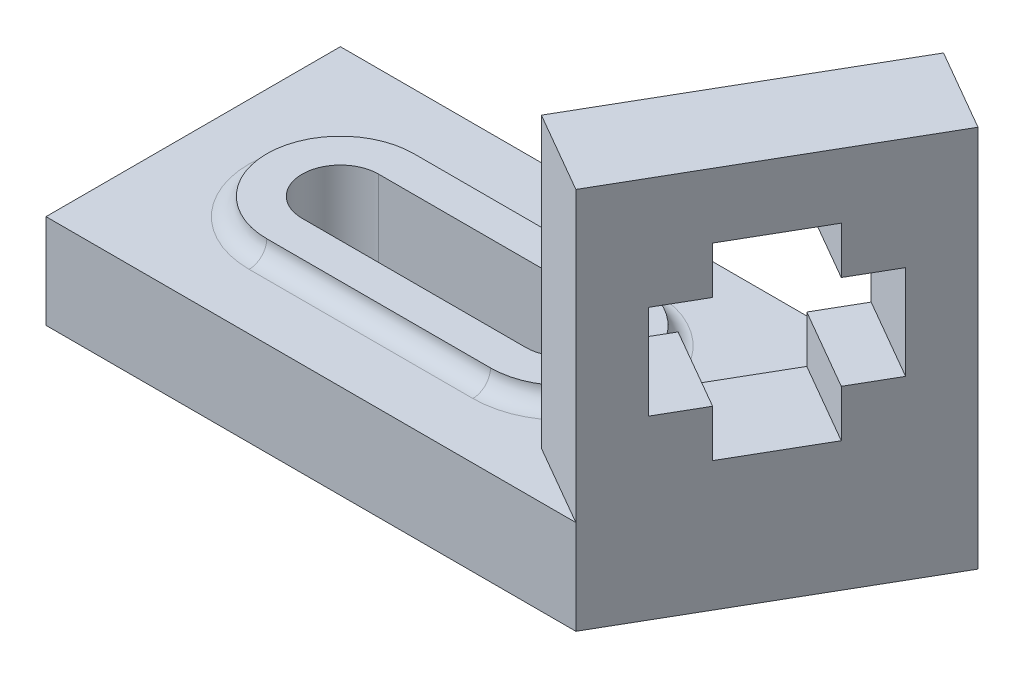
ISO-10303-21;
HEADER;
FILE_DESCRIPTION(('STEP AP214'),'2;1');
FILE_NAME('part.step','',(''),(''),'','','');
FILE_SCHEMA(('AUTOMOTIVE_DESIGN { 1 0 10303 214 1 1 1 1 }'));
ENDSEC;
DATA;
#1=APPLICATION_CONTEXT('core data for automotive mechanical design processes');
#2=APPLICATION_PROTOCOL_DEFINITION('international standard','automotive_design',2000,#1);
#3=PRODUCT_CONTEXT('',#1,'mechanical');
#4=PRODUCT('Part','Part','',(#3));
#5=PRODUCT_RELATED_PRODUCT_CATEGORY('part','',(#4));
#6=PRODUCT_DEFINITION_FORMATION('','',#4);
#7=PRODUCT_DEFINITION_CONTEXT('part definition',#1,'design');
#8=PRODUCT_DEFINITION('design','',#6,#7);
#9=PRODUCT_DEFINITION_SHAPE('','',#8);
#10=(LENGTH_UNIT() NAMED_UNIT(*) SI_UNIT(.MILLI.,.METRE.));
#11=(NAMED_UNIT(*) PLANE_ANGLE_UNIT() SI_UNIT($,.RADIAN.));
#12=(NAMED_UNIT(*) SI_UNIT($,.STERADIAN.) SOLID_ANGLE_UNIT());
#13=UNCERTAINTY_MEASURE_WITH_UNIT(LENGTH_MEASURE(1.E-05),#10,'distance_accuracy_value','');
#14=(GEOMETRIC_REPRESENTATION_CONTEXT(3) GLOBAL_UNCERTAINTY_ASSIGNED_CONTEXT((#13)) GLOBAL_UNIT_ASSIGNED_CONTEXT((#10,
#11,#12)) REPRESENTATION_CONTEXT('',''));
#15=CARTESIAN_POINT('',(0.,0.,0.));
#16=DIRECTION('',(0.,0.,1.));
#17=DIRECTION('',(1.,0.,0.));
#18=AXIS2_PLACEMENT_3D('',#15,#16,#17);
#19=CARTESIAN_POINT('',(0.,16.,0.));
#20=DIRECTION('',(0.,-1.,0.));
#21=DIRECTION('',(0.,0.,-1.));
#22=AXIS2_PLACEMENT_3D('',#19,#20,#21);
#23=PLANE('',#22);
#24=CARTESIAN_POINT('',(25.,16.,-25.));
#25=DIRECTION('',(0.,-1.,0.));
#26=DIRECTION('',(0.,0.,-1.));
#27=AXIS2_PLACEMENT_3D('',#24,#25,#26);
#28=CIRCLE('',#27,15.5);
#29=CARTESIAN_POINT('',(25.,16.,-9.50000000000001));
#30=VERTEX_POINT('',#29);
#31=CARTESIAN_POINT('',(25.,16.,-40.5));
#32=VERTEX_POINT('',#31);
#33=EDGE_CURVE('E434',#30,#32,#28,.T.);
#34=ORIENTED_EDGE('',*,*,#33,.T.);
#35=DIRECTION('',(-1.,0.,0.));
#36=VECTOR('',#35,1.);
#37=CARTESIAN_POINT('',(63.,16.,-40.5));
#38=LINE('',#37,#36);
#39=CARTESIAN_POINT('',(63.,16.,-40.5));
#40=VERTEX_POINT('',#39);
#41=EDGE_CURVE('E11',#32,#40,#38,.F.);
#42=ORIENTED_EDGE('',*,*,#41,.T.);
#43=CARTESIAN_POINT('',(63.,16.,-25.));
#44=DIRECTION('',(0.,-1.,0.));
#45=DIRECTION('',(0.,0.,-1.));
#46=AXIS2_PLACEMENT_3D('',#43,#44,#45);
#47=CIRCLE('',#46,15.5);
#48=CARTESIAN_POINT('',(63.,16.,-9.5));
#49=VERTEX_POINT('',#48);
#50=EDGE_CURVE('E42',#40,#49,#47,.T.);
#51=ORIENTED_EDGE('',*,*,#50,.T.);
#52=DIRECTION('',(1.,0.,0.));
#53=VECTOR('',#52,1.);
#54=CARTESIAN_POINT('',(25.,16.,-9.5));
#55=LINE('',#54,#53);
#56=EDGE_CURVE('E436',#49,#30,#55,.F.);
#57=ORIENTED_EDGE('',*,*,#56,.T.);
#58=EDGE_LOOP('',(#34,#42,#51,#57));
#59=FACE_BOUND('',#58,.T.);
#60=DIRECTION('',(0.86602540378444,0.,0.499999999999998));
#61=VECTOR('',#60,1.);
#62=CARTESIAN_POINT('',(76.143593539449,16.,-7.99999999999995));
#63=LINE('',#62,#61);
#64=CARTESIAN_POINT('',(76.143593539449,16.,-7.99999999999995));
#65=VERTEX_POINT('',#64);
#66=CARTESIAN_POINT('',(90.,16.,0.));
#67=VERTEX_POINT('',#66);
#68=EDGE_CURVE('E382',#65,#67,#63,.T.);
#69=ORIENTED_EDGE('',*,*,#68,.F.);
#70=DIRECTION('',(0.499999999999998,0.,-0.86602540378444));
#71=VECTOR('',#70,1.);
#72=CARTESIAN_POINT('',(76.143593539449,16.,-7.99999999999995));
#73=LINE('',#72,#71);
#74=CARTESIAN_POINT('',(101.143593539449,16.,-51.301270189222));
#75=VERTEX_POINT('',#74);
#76=EDGE_CURVE('E372',#65,#75,#73,.T.);
#77=ORIENTED_EDGE('',*,*,#76,.T.);
#78=DIRECTION('',(-0.993250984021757,0.,0.115984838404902));
#79=VECTOR('',#78,1.);
#80=CARTESIAN_POINT('',(101.143593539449,16.,-51.301270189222));
#81=LINE('',#80,#79);
#82=CARTESIAN_POINT('',(90.,16.,-50.));
#83=VERTEX_POINT('',#82);
#84=EDGE_CURVE('E401',#75,#83,#81,.T.);
#85=ORIENTED_EDGE('',*,*,#84,.T.);
#86=DIRECTION('',(-1.,0.,0.));
#87=VECTOR('',#86,1.);
#88=CARTESIAN_POINT('',(0.,16.,-50.));
#89=LINE('',#88,#87);
#90=CARTESIAN_POINT('',(0.,16.,-50.));
#91=VERTEX_POINT('',#90);
#92=EDGE_CURVE('E403',#83,#91,#89,.T.);
#93=ORIENTED_EDGE('',*,*,#92,.T.);
#94=DIRECTION('',(0.,0.,1.));
#95=VECTOR('',#94,1.);
#96=CARTESIAN_POINT('',(0.,16.,0.));
#97=LINE('',#96,#95);
#98=CARTESIAN_POINT('',(0.,16.,0.));
#99=VERTEX_POINT('',#98);
#100=EDGE_CURVE('E394',#91,#99,#97,.T.);
#101=ORIENTED_EDGE('',*,*,#100,.T.);
#102=DIRECTION('',(1.,0.,0.));
#103=VECTOR('',#102,1.);
#104=CARTESIAN_POINT('',(0.,16.,0.));
#105=LINE('',#104,#103);
#106=EDGE_CURVE('E397',#99,#67,#105,.T.);
#107=ORIENTED_EDGE('',*,*,#106,.T.);
#108=EDGE_LOOP('',(#69,#77,#85,#93,#101,#107));
#109=FACE_BOUND('',#108,.T.);
#110=ADVANCED_FACE('F33',(#59,#109),#23,.F.);
#111=CARTESIAN_POINT('',(0.,16.,0.));
#112=DIRECTION('',(1.,0.,0.));
#113=DIRECTION('',(0.,0.,-1.));
#114=AXIS2_PLACEMENT_3D('',#111,#112,#113);
#115=PLANE('',#114);
#116=DIRECTION('',(0.,0.,1.));
#117=VECTOR('',#116,1.);
#118=CARTESIAN_POINT('',(0.,0.,0.));
#119=LINE('',#118,#117);
#120=CARTESIAN_POINT('',(0.,0.,-50.));
#121=VERTEX_POINT('',#120);
#122=CARTESIAN_POINT('',(0.,0.,0.));
#123=VERTEX_POINT('',#122);
#124=EDGE_CURVE('E389',#121,#123,#119,.T.);
#125=ORIENTED_EDGE('',*,*,#124,.T.);
#126=DIRECTION('',(0.,-1.,0.));
#127=VECTOR('',#126,1.);
#128=CARTESIAN_POINT('',(0.,16.,0.));
#129=LINE('',#128,#127);
#130=EDGE_CURVE('E431',#99,#123,#129,.T.);
#131=ORIENTED_EDGE('',*,*,#130,.F.);
#132=ORIENTED_EDGE('',*,*,#100,.F.);
#133=DIRECTION('',(0.,-1.,0.));
#134=VECTOR('',#133,1.);
#135=CARTESIAN_POINT('',(0.,16.,-50.));
#136=LINE('',#135,#134);
#137=EDGE_CURVE('E405',#91,#121,#136,.T.);
#138=ORIENTED_EDGE('',*,*,#137,.T.);
#139=EDGE_LOOP('',(#125,#131,#132,#138));
#140=FACE_BOUND('',#139,.T.);
#141=ADVANCED_FACE('F469',(#140),#115,.F.);
#142=CARTESIAN_POINT('',(0.,16.,0.));
#143=DIRECTION('',(0.,0.,-1.));
#144=DIRECTION('',(-1.,0.,0.));
#145=AXIS2_PLACEMENT_3D('',#142,#143,#144);
#146=PLANE('',#145);
#147=DIRECTION('',(1.,0.,0.));
#148=VECTOR('',#147,1.);
#149=CARTESIAN_POINT('',(0.,0.,0.));
#150=LINE('',#149,#148);
#151=CARTESIAN_POINT('',(90.,0.,0.));
#152=VERTEX_POINT('',#151);
#153=EDGE_CURVE('E408',#123,#152,#150,.T.);
#154=ORIENTED_EDGE('',*,*,#153,.T.);
#155=DIRECTION('',(0.,-1.,0.));
#156=VECTOR('',#155,1.);
#157=CARTESIAN_POINT('',(90.,16.,0.));
#158=LINE('',#157,#156);
#159=EDGE_CURVE('E428',#67,#152,#158,.T.);
#160=ORIENTED_EDGE('',*,*,#159,.F.);
#161=ORIENTED_EDGE('',*,*,#106,.F.);
#162=ORIENTED_EDGE('',*,*,#130,.T.);
#163=EDGE_LOOP('',(#154,#160,#161,#162));
#164=FACE_BOUND('',#163,.T.);
#165=ADVANCED_FACE('F474',(#164),#146,.F.);
#166=CARTESIAN_POINT('',(90.,16.,0.));
#167=DIRECTION('',(-0.86602540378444,0.,-0.499999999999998));
#168=DIRECTION('',(-0.499999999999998,0.,0.86602540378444));
#169=AXIS2_PLACEMENT_3D('',#166,#167,#168);
#170=PLANE('',#169);
#171=DIRECTION('',(0.499999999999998,0.,-0.86602540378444));
#172=VECTOR('',#171,1.);
#173=CARTESIAN_POINT('',(90.,0.,0.));
#174=LINE('',#173,#172);
#175=CARTESIAN_POINT('',(115.,0.,-43.301270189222));
#176=VERTEX_POINT('',#175);
#177=EDGE_CURVE('E410',#152,#176,#174,.T.);
#178=ORIENTED_EDGE('',*,*,#177,.T.);
#179=DIRECTION('',(0.,-1.,0.));
#180=VECTOR('',#179,1.);
#181=CARTESIAN_POINT('',(115.,16.,-43.301270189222));
#182=LINE('',#181,#180);
#183=CARTESIAN_POINT('',(115.,65.,-43.301270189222));
#184=VERTEX_POINT('',#183);
#185=EDGE_CURVE('E425',#184,#176,#182,.T.);
#186=ORIENTED_EDGE('',*,*,#185,.F.);
#187=DIRECTION('',(-0.499999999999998,0.,0.86602540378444));
#188=VECTOR('',#187,1.);
#189=CARTESIAN_POINT('',(90.,65.,0.));
#190=LINE('',#189,#188);
#191=CARTESIAN_POINT('',(90.,65.,0.));
#192=VERTEX_POINT('',#191);
#193=EDGE_CURVE('E373',#184,#192,#190,.T.);
#194=ORIENTED_EDGE('',*,*,#193,.T.);
#195=DIRECTION('',(0.,-1.,0.));
#196=VECTOR('',#195,1.);
#197=CARTESIAN_POINT('',(90.,16.,0.));
#198=LINE('',#197,#196);
#199=EDGE_CURVE('E346',#192,#67,#198,.T.);
#200=ORIENTED_EDGE('',*,*,#199,.T.);
#201=ORIENTED_EDGE('',*,*,#159,.T.);
#202=EDGE_LOOP('',(#178,#186,#194,#200,#201));
#203=FACE_BOUND('',#202,.T.);
#204=DIRECTION('',(0.499999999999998,0.,-0.86602540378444));
#205=VECTOR('',#204,1.);
#206=CARTESIAN_POINT('',(94.5,30.,-7.79422863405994));
#207=LINE('',#206,#205);
#208=CARTESIAN_POINT('',(94.5,30.,-7.79422863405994));
#209=VERTEX_POINT('',#208);
#210=CARTESIAN_POINT('',(98.5,30.,-14.7224318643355));
#211=VERTEX_POINT('',#210);
#212=EDGE_CURVE('E312',#209,#211,#207,.T.);
#213=ORIENTED_EDGE('',*,*,#212,.F.);
#214=DIRECTION('',(0.,-1.,0.));
#215=VECTOR('',#214,1.);
#216=CARTESIAN_POINT('',(94.5,46.,-7.79422863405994));
#217=LINE('',#216,#215);
#218=CARTESIAN_POINT('',(94.5,46.,-7.79422863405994));
#219=VERTEX_POINT('',#218);
#220=EDGE_CURVE('E269',#219,#209,#217,.T.);
#221=ORIENTED_EDGE('',*,*,#220,.F.);
#222=DIRECTION('',(-0.499999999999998,0.,0.86602540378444));
#223=VECTOR('',#222,1.);
#224=CARTESIAN_POINT('',(94.5,46.,-7.79422863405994));
#225=LINE('',#224,#223);
#226=CARTESIAN_POINT('',(98.5,46.,-14.7224318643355));
#227=VERTEX_POINT('',#226);
#228=EDGE_CURVE('E277',#227,#219,#225,.T.);
#229=ORIENTED_EDGE('',*,*,#228,.F.);
#230=DIRECTION('',(0.,-1.,0.));
#231=VECTOR('',#230,1.);
#232=CARTESIAN_POINT('',(98.5,54.,-14.7224318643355));
#233=LINE('',#232,#231);
#234=CARTESIAN_POINT('',(98.5,54.,-14.7224318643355));
#235=VERTEX_POINT('',#234);
#236=EDGE_CURVE('E339',#235,#227,#233,.T.);
#237=ORIENTED_EDGE('',*,*,#236,.F.);
#238=DIRECTION('',(-0.499999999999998,0.,0.86602540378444));
#239=VECTOR('',#238,1.);
#240=CARTESIAN_POINT('',(98.5,54.,-14.7224318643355));
#241=LINE('',#240,#239);
#242=CARTESIAN_POINT('',(106.5,54.,-28.5788383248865));
#243=VERTEX_POINT('',#242);
#244=EDGE_CURVE('E336',#243,#235,#241,.T.);
#245=ORIENTED_EDGE('',*,*,#244,.F.);
#246=DIRECTION('',(0.,1.,0.));
#247=VECTOR('',#246,1.);
#248=CARTESIAN_POINT('',(106.5,54.,-28.5788383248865));
#249=LINE('',#248,#247);
#250=CARTESIAN_POINT('',(106.5,46.,-28.5788383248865));
#251=VERTEX_POINT('',#250);
#252=EDGE_CURVE('E333',#251,#243,#249,.T.);
#253=ORIENTED_EDGE('',*,*,#252,.F.);
#254=DIRECTION('',(-0.499999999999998,0.,0.86602540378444));
#255=VECTOR('',#254,1.);
#256=CARTESIAN_POINT('',(106.5,46.,-28.5788383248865));
#257=LINE('',#256,#255);
#258=CARTESIAN_POINT('',(110.5,46.,-35.507041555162));
#259=VERTEX_POINT('',#258);
#260=EDGE_CURVE('E330',#259,#251,#257,.T.);
#261=ORIENTED_EDGE('',*,*,#260,.F.);
#262=DIRECTION('',(0.,1.,0.));
#263=VECTOR('',#262,1.);
#264=CARTESIAN_POINT('',(110.5,46.,-35.507041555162));
#265=LINE('',#264,#263);
#266=CARTESIAN_POINT('',(110.5,30.,-35.507041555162));
#267=VERTEX_POINT('',#266);
#268=EDGE_CURVE('E327',#267,#259,#265,.T.);
#269=ORIENTED_EDGE('',*,*,#268,.F.);
#270=DIRECTION('',(0.499999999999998,0.,-0.86602540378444));
#271=VECTOR('',#270,1.);
#272=CARTESIAN_POINT('',(106.5,30.,-28.5788383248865));
#273=LINE('',#272,#271);
#274=CARTESIAN_POINT('',(106.5,30.,-28.5788383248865));
#275=VERTEX_POINT('',#274);
#276=EDGE_CURVE('E324',#275,#267,#273,.T.);
#277=ORIENTED_EDGE('',*,*,#276,.F.);
#278=DIRECTION('',(0.,1.,0.));
#279=VECTOR('',#278,1.);
#280=CARTESIAN_POINT('',(106.5,30.,-28.5788383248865));
#281=LINE('',#280,#279);
#282=CARTESIAN_POINT('',(106.5,22.,-28.5788383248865));
#283=VERTEX_POINT('',#282);
#284=EDGE_CURVE('E321',#283,#275,#281,.T.);
#285=ORIENTED_EDGE('',*,*,#284,.F.);
#286=DIRECTION('',(0.499999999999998,0.,-0.86602540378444));
#287=VECTOR('',#286,1.);
#288=CARTESIAN_POINT('',(98.5,22.,-14.7224318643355));
#289=LINE('',#288,#287);
#290=CARTESIAN_POINT('',(98.5,22.,-14.7224318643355));
#291=VERTEX_POINT('',#290);
#292=EDGE_CURVE('E318',#291,#283,#289,.T.);
#293=ORIENTED_EDGE('',*,*,#292,.F.);
#294=DIRECTION('',(0.,-1.,0.));
#295=VECTOR('',#294,1.);
#296=CARTESIAN_POINT('',(98.5,30.,-14.7224318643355));
#297=LINE('',#296,#295);
#298=EDGE_CURVE('E315',#211,#291,#297,.T.);
#299=ORIENTED_EDGE('',*,*,#298,.F.);
#300=EDGE_LOOP('',(#213,#221,#229,#237,#245,#253,#261,#269,#277,#285,#293,#299));
#301=FACE_BOUND('',#300,.T.);
#302=ADVANCED_FACE('F496',(#203,#301),#170,.F.);
#303=CARTESIAN_POINT('',(115.,16.,-43.301270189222));
#304=DIRECTION('',(-0.499999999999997,0.,0.86602540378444));
#305=DIRECTION('',(0.86602540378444,0.,0.499999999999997));
#306=AXIS2_PLACEMENT_3D('',#303,#304,#305);
#307=PLANE('',#306);
#308=DIRECTION('',(-0.86602540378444,0.,-0.499999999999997));
#309=VECTOR('',#308,1.);
#310=CARTESIAN_POINT('',(115.,0.,-43.301270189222));
#311=LINE('',#310,#309);
#312=CARTESIAN_POINT('',(101.143593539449,0.,-51.301270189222));
#313=VERTEX_POINT('',#312);
#314=EDGE_CURVE('E412',#176,#313,#311,.T.);
#315=ORIENTED_EDGE('',*,*,#314,.T.);
#316=DIRECTION('',(0.,-1.,0.));
#317=VECTOR('',#316,1.);
#318=CARTESIAN_POINT('',(101.143593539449,16.,-51.301270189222));
#319=LINE('',#318,#317);
#320=EDGE_CURVE('E422',#75,#313,#319,.T.);
#321=ORIENTED_EDGE('',*,*,#320,.F.);
#322=DIRECTION('',(0.,1.,0.));
#323=VECTOR('',#322,1.);
#324=CARTESIAN_POINT('',(101.143593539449,16.,-51.3012701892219));
#325=LINE('',#324,#323);
#326=CARTESIAN_POINT('',(101.143593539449,65.,-51.3012701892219));
#327=VERTEX_POINT('',#326);
#328=EDGE_CURVE('E376',#75,#327,#325,.T.);
#329=ORIENTED_EDGE('',*,*,#328,.T.);
#330=DIRECTION('',(0.86602540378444,0.,0.499999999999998));
#331=VECTOR('',#330,1.);
#332=CARTESIAN_POINT('',(101.143593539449,65.,-51.3012701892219));
#333=LINE('',#332,#331);
#334=EDGE_CURVE('E390',#327,#184,#333,.T.);
#335=ORIENTED_EDGE('',*,*,#334,.T.);
#336=ORIENTED_EDGE('',*,*,#185,.T.);
#337=EDGE_LOOP('',(#315,#321,#329,#335,#336));
#338=FACE_BOUND('',#337,.T.);
#339=ADVANCED_FACE('F492',(#338),#307,.F.);
#340=CARTESIAN_POINT('',(101.143593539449,16.,-51.301270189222));
#341=DIRECTION('',(0.115984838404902,0.,0.993250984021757));
#342=DIRECTION('',(0.993250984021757,0.,-0.115984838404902));
#343=AXIS2_PLACEMENT_3D('',#340,#341,#342);
#344=PLANE('',#343);
#345=DIRECTION('',(-0.993250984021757,0.,0.115984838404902));
#346=VECTOR('',#345,1.);
#347=CARTESIAN_POINT('',(101.143593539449,0.,-51.301270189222));
#348=LINE('',#347,#346);
#349=CARTESIAN_POINT('',(90.,0.,-50.));
#350=VERTEX_POINT('',#349);
#351=EDGE_CURVE('E414',#313,#350,#348,.T.);
#352=ORIENTED_EDGE('',*,*,#351,.T.);
#353=DIRECTION('',(0.,-1.,0.));
#354=VECTOR('',#353,1.);
#355=CARTESIAN_POINT('',(90.,16.,-50.));
#356=LINE('',#355,#354);
#357=EDGE_CURVE('E419',#83,#350,#356,.T.);
#358=ORIENTED_EDGE('',*,*,#357,.F.);
#359=ORIENTED_EDGE('',*,*,#84,.F.);
#360=ORIENTED_EDGE('',*,*,#320,.T.);
#361=EDGE_LOOP('',(#352,#358,#359,#360));
#362=FACE_BOUND('',#361,.T.);
#363=ADVANCED_FACE('F488',(#362),#344,.F.);
#364=CARTESIAN_POINT('',(0.,16.,-50.));
#365=DIRECTION('',(0.,0.,1.));
#366=DIRECTION('',(1.,0.,0.));
#367=AXIS2_PLACEMENT_3D('',#364,#365,#366);
#368=PLANE('',#367);
#369=DIRECTION('',(-1.,0.,0.));
#370=VECTOR('',#369,1.);
#371=CARTESIAN_POINT('',(0.,0.,-50.));
#372=LINE('',#371,#370);
#373=EDGE_CURVE('E398',#350,#121,#372,.T.);
#374=ORIENTED_EDGE('',*,*,#373,.T.);
#375=ORIENTED_EDGE('',*,*,#137,.F.);
#376=ORIENTED_EDGE('',*,*,#92,.F.);
#377=ORIENTED_EDGE('',*,*,#357,.T.);
#378=EDGE_LOOP('',(#374,#375,#376,#377));
#379=FACE_BOUND('',#378,.T.);
#380=ADVANCED_FACE('F484',(#379),#368,.F.);
#381=CARTESIAN_POINT('',(0.,0.,0.));
#382=DIRECTION('',(0.,-1.,0.));
#383=DIRECTION('',(0.,0.,-1.));
#384=AXIS2_PLACEMENT_3D('',#381,#382,#383);
#385=PLANE('',#384);
#386=CARTESIAN_POINT('',(25.,0.,-25.));
#387=DIRECTION('',(0.,1.,0.));
#388=DIRECTION('',(0.,0.,1.));
#389=AXIS2_PLACEMENT_3D('',#386,#387,#388);
#390=CIRCLE('',#389,6.5);
#391=CARTESIAN_POINT('',(25.,0.,-31.5));
#392=VERTEX_POINT('',#391);
#393=CARTESIAN_POINT('',(25.,0.,-18.5));
#394=VERTEX_POINT('',#393);
#395=EDGE_CURVE('E260',#392,#394,#390,.T.);
#396=ORIENTED_EDGE('',*,*,#395,.T.);
#397=DIRECTION('',(1.,0.,0.));
#398=VECTOR('',#397,1.);
#399=CARTESIAN_POINT('',(25.,0.,-18.5));
#400=LINE('',#399,#398);
#401=CARTESIAN_POINT('',(63.,0.,-18.5));
#402=VERTEX_POINT('',#401);
#403=EDGE_CURVE('E228',#394,#402,#400,.T.);
#404=ORIENTED_EDGE('',*,*,#403,.T.);
#405=CARTESIAN_POINT('',(63.,0.,-25.));
#406=DIRECTION('',(0.,1.,0.));
#407=DIRECTION('',(0.,0.,1.));
#408=AXIS2_PLACEMENT_3D('',#405,#406,#407);
#409=CIRCLE('',#408,6.5);
#410=CARTESIAN_POINT('',(63.,0.,-31.5));
#411=VERTEX_POINT('',#410);
#412=EDGE_CURVE('E263',#402,#411,#409,.T.);
#413=ORIENTED_EDGE('',*,*,#412,.T.);
#414=DIRECTION('',(-1.,0.,0.));
#415=VECTOR('',#414,1.);
#416=CARTESIAN_POINT('',(25.,0.,-31.5));
#417=LINE('',#416,#415);
#418=EDGE_CURVE('E233',#411,#392,#417,.T.);
#419=ORIENTED_EDGE('',*,*,#418,.T.);
#420=EDGE_LOOP('',(#396,#404,#413,#419));
#421=FACE_BOUND('',#420,.T.);
#422=ORIENTED_EDGE('',*,*,#124,.F.);
#423=ORIENTED_EDGE('',*,*,#373,.F.);
#424=ORIENTED_EDGE('',*,*,#351,.F.);
#425=ORIENTED_EDGE('',*,*,#314,.F.);
#426=ORIENTED_EDGE('',*,*,#177,.F.);
#427=ORIENTED_EDGE('',*,*,#153,.F.);
#428=EDGE_LOOP('',(#422,#423,#424,#425,#426,#427));
#429=FACE_BOUND('',#428,.T.);
#430=ADVANCED_FACE('F481',(#421,#429),#385,.T.);
#431=CARTESIAN_POINT('',(76.143593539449,16.,-7.99999999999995));
#432=DIRECTION('',(-0.499999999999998,0.,0.86602540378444));
#433=DIRECTION('',(0.86602540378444,0.,0.499999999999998));
#434=AXIS2_PLACEMENT_3D('',#431,#432,#433);
#435=PLANE('',#434);
#436=ORIENTED_EDGE('',*,*,#199,.F.);
#437=DIRECTION('',(0.86602540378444,0.,0.499999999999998));
#438=VECTOR('',#437,1.);
#439=CARTESIAN_POINT('',(76.143593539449,65.,-7.99999999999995));
#440=LINE('',#439,#438);
#441=CARTESIAN_POINT('',(76.143593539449,65.,-7.99999999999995));
#442=VERTEX_POINT('',#441);
#443=EDGE_CURVE('E387',#442,#192,#440,.T.);
#444=ORIENTED_EDGE('',*,*,#443,.F.);
#445=DIRECTION('',(0.,-1.,0.));
#446=VECTOR('',#445,1.);
#447=CARTESIAN_POINT('',(76.143593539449,16.,-7.99999999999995));
#448=LINE('',#447,#446);
#449=EDGE_CURVE('E369',#442,#65,#448,.T.);
#450=ORIENTED_EDGE('',*,*,#449,.T.);
#451=ORIENTED_EDGE('',*,*,#68,.T.);
#452=EDGE_LOOP('',(#436,#444,#450,#451));
#453=FACE_BOUND('',#452,.T.);
#454=ADVANCED_FACE('F479',(#453),#435,.T.);
#455=CARTESIAN_POINT('',(76.143593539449,65.,-7.99999999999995));
#456=DIRECTION('',(0.,1.,0.));
#457=DIRECTION('',(0.,0.,1.));
#458=AXIS2_PLACEMENT_3D('',#455,#456,#457);
#459=PLANE('',#458);
#460=ORIENTED_EDGE('',*,*,#193,.F.);
#461=ORIENTED_EDGE('',*,*,#334,.F.);
#462=DIRECTION('',(-0.499999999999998,0.,0.86602540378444));
#463=VECTOR('',#462,1.);
#464=CARTESIAN_POINT('',(76.143593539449,65.,-7.99999999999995));
#465=LINE('',#464,#463);
#466=EDGE_CURVE('E379',#327,#442,#465,.T.);
#467=ORIENTED_EDGE('',*,*,#466,.T.);
#468=ORIENTED_EDGE('',*,*,#443,.T.);
#469=EDGE_LOOP('',(#460,#461,#467,#468));
#470=FACE_BOUND('',#469,.T.);
#471=ADVANCED_FACE('F716',(#470),#459,.T.);
#472=CARTESIAN_POINT('',(53.6435935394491,0.,30.9711431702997));
#473=DIRECTION('',(-0.86602540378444,0.,-0.499999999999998));
#474=DIRECTION('',(-0.499999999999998,0.,0.86602540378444));
#475=AXIS2_PLACEMENT_3D('',#472,#473,#474);
#476=PLANE('',#475);
#477=DIRECTION('',(0.,-1.,0.));
#478=VECTOR('',#477,1.);
#479=CARTESIAN_POINT('',(80.643593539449,46.,-15.7942286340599));
#480=LINE('',#479,#478);
#481=CARTESIAN_POINT('',(80.643593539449,46.,-15.7942286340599));
#482=VERTEX_POINT('',#481);
#483=CARTESIAN_POINT('',(80.643593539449,30.,-15.7942286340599));
#484=VERTEX_POINT('',#483);
#485=EDGE_CURVE('E273',#482,#484,#480,.T.);
#486=ORIENTED_EDGE('',*,*,#485,.T.);
#487=DIRECTION('',(0.499999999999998,0.,-0.86602540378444));
#488=VECTOR('',#487,1.);
#489=CARTESIAN_POINT('',(80.643593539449,30.,-15.7942286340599));
#490=LINE('',#489,#488);
#491=CARTESIAN_POINT('',(84.6435935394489,30.,-22.7224318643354));
#492=VERTEX_POINT('',#491);
#493=EDGE_CURVE('E276',#484,#492,#490,.T.);
#494=ORIENTED_EDGE('',*,*,#493,.T.);
#495=DIRECTION('',(0.,-1.,0.));
#496=VECTOR('',#495,1.);
#497=CARTESIAN_POINT('',(84.6435935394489,30.,-22.7224318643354));
#498=LINE('',#497,#496);
#499=CARTESIAN_POINT('',(84.6435935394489,22.,-22.7224318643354));
#500=VERTEX_POINT('',#499);
#501=EDGE_CURVE('E280',#492,#500,#498,.T.);
#502=ORIENTED_EDGE('',*,*,#501,.T.);
#503=DIRECTION('',(0.499999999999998,0.,-0.86602540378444));
#504=VECTOR('',#503,1.);
#505=CARTESIAN_POINT('',(84.6435935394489,22.,-22.7224318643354));
#506=LINE('',#505,#504);
#507=CARTESIAN_POINT('',(92.6435935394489,22.,-36.5788383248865));
#508=VERTEX_POINT('',#507);
#509=EDGE_CURVE('E283',#500,#508,#506,.T.);
#510=ORIENTED_EDGE('',*,*,#509,.T.);
#511=DIRECTION('',(0.,1.,0.));
#512=VECTOR('',#511,1.);
#513=CARTESIAN_POINT('',(92.6435935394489,30.,-36.5788383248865));
#514=LINE('',#513,#512);
#515=CARTESIAN_POINT('',(92.6435935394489,30.,-36.5788383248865));
#516=VERTEX_POINT('',#515);
#517=EDGE_CURVE('E286',#508,#516,#514,.T.);
#518=ORIENTED_EDGE('',*,*,#517,.T.);
#519=DIRECTION('',(0.499999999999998,0.,-0.86602540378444));
#520=VECTOR('',#519,1.);
#521=CARTESIAN_POINT('',(92.6435935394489,30.,-36.5788383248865));
#522=LINE('',#521,#520);
#523=CARTESIAN_POINT('',(96.6435935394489,30.,-43.507041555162));
#524=VERTEX_POINT('',#523);
#525=EDGE_CURVE('E289',#516,#524,#522,.T.);
#526=ORIENTED_EDGE('',*,*,#525,.T.);
#527=DIRECTION('',(0.,1.,0.));
#528=VECTOR('',#527,1.);
#529=CARTESIAN_POINT('',(96.6435935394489,46.,-43.507041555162));
#530=LINE('',#529,#528);
#531=CARTESIAN_POINT('',(96.6435935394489,46.,-43.507041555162));
#532=VERTEX_POINT('',#531);
#533=EDGE_CURVE('E292',#524,#532,#530,.T.);
#534=ORIENTED_EDGE('',*,*,#533,.T.);
#535=DIRECTION('',(-0.499999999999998,0.,0.86602540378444));
#536=VECTOR('',#535,1.);
#537=CARTESIAN_POINT('',(92.6435935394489,46.,-36.5788383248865));
#538=LINE('',#537,#536);
#539=CARTESIAN_POINT('',(92.6435935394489,46.,-36.5788383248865));
#540=VERTEX_POINT('',#539);
#541=EDGE_CURVE('E295',#532,#540,#538,.T.);
#542=ORIENTED_EDGE('',*,*,#541,.T.);
#543=DIRECTION('',(0.,1.,0.));
#544=VECTOR('',#543,1.);
#545=CARTESIAN_POINT('',(92.6435935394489,54.,-36.5788383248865));
#546=LINE('',#545,#544);
#547=CARTESIAN_POINT('',(92.6435935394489,54.,-36.5788383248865));
#548=VERTEX_POINT('',#547);
#549=EDGE_CURVE('E298',#540,#548,#546,.T.);
#550=ORIENTED_EDGE('',*,*,#549,.T.);
#551=DIRECTION('',(-0.499999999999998,0.,0.86602540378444));
#552=VECTOR('',#551,1.);
#553=CARTESIAN_POINT('',(84.6435935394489,54.,-22.7224318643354));
#554=LINE('',#553,#552);
#555=CARTESIAN_POINT('',(84.6435935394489,54.,-22.7224318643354));
#556=VERTEX_POINT('',#555);
#557=EDGE_CURVE('E301',#548,#556,#554,.T.);
#558=ORIENTED_EDGE('',*,*,#557,.T.);
#559=DIRECTION('',(0.,-1.,0.));
#560=VECTOR('',#559,1.);
#561=CARTESIAN_POINT('',(84.6435935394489,54.,-22.7224318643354));
#562=LINE('',#561,#560);
#563=CARTESIAN_POINT('',(84.6435935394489,46.,-22.7224318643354));
#564=VERTEX_POINT('',#563);
#565=EDGE_CURVE('E304',#556,#564,#562,.T.);
#566=ORIENTED_EDGE('',*,*,#565,.T.);
#567=DIRECTION('',(-0.499999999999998,0.,0.86602540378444));
#568=VECTOR('',#567,1.);
#569=CARTESIAN_POINT('',(80.643593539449,46.,-15.7942286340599));
#570=LINE('',#569,#568);
#571=EDGE_CURVE('E307',#564,#482,#570,.T.);
#572=ORIENTED_EDGE('',*,*,#571,.T.);
#573=EDGE_LOOP('',(#486,#494,#502,#510,#518,#526,#534,#542,#550,#558,#566,#572));
#574=FACE_BOUND('',#573,.T.);
#575=ORIENTED_EDGE('',*,*,#449,.F.);
#576=ORIENTED_EDGE('',*,*,#466,.F.);
#577=ORIENTED_EDGE('',*,*,#328,.F.);
#578=ORIENTED_EDGE('',*,*,#76,.F.);
#579=EDGE_LOOP('',(#575,#576,#577,#578));
#580=FACE_BOUND('',#579,.T.);
#581=ADVANCED_FACE('F706',(#574,#580),#476,.T.);
#582=CARTESIAN_POINT('',(80.643593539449,46.,-15.7942286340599));
#583=DIRECTION('',(-0.499999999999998,0.,0.86602540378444));
#584=DIRECTION('',(0.86602540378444,0.,0.499999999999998));
#585=AXIS2_PLACEMENT_3D('',#582,#583,#584);
#586=PLANE('',#585);
#587=ORIENTED_EDGE('',*,*,#220,.T.);
#588=DIRECTION('',(0.86602540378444,0.,0.499999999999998));
#589=VECTOR('',#588,1.);
#590=CARTESIAN_POINT('',(80.643593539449,30.,-15.7942286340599));
#591=LINE('',#590,#589);
#592=EDGE_CURVE('E310',#484,#209,#591,.T.);
#593=ORIENTED_EDGE('',*,*,#592,.F.);
#594=ORIENTED_EDGE('',*,*,#485,.F.);
#595=DIRECTION('',(0.86602540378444,0.,0.499999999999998));
#596=VECTOR('',#595,1.);
#597=CARTESIAN_POINT('',(80.643593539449,46.,-15.7942286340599));
#598=LINE('',#597,#596);
#599=EDGE_CURVE('E344',#482,#219,#598,.T.);
#600=ORIENTED_EDGE('',*,*,#599,.T.);
#601=EDGE_LOOP('',(#587,#593,#594,#600));
#602=FACE_BOUND('',#601,.T.);
#603=ADVANCED_FACE('F696',(#602),#586,.F.);
#604=CARTESIAN_POINT('',(80.643593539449,46.,-15.7942286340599));
#605=DIRECTION('',(0.,1.,0.));
#606=DIRECTION('',(0.,0.,1.));
#607=AXIS2_PLACEMENT_3D('',#604,#605,#606);
#608=PLANE('',#607);
#609=ORIENTED_EDGE('',*,*,#228,.T.);
#610=ORIENTED_EDGE('',*,*,#599,.F.);
#611=ORIENTED_EDGE('',*,*,#571,.F.);
#612=DIRECTION('',(0.86602540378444,0.,0.499999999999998));
#613=VECTOR('',#612,1.);
#614=CARTESIAN_POINT('',(84.6435935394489,46.,-22.7224318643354));
#615=LINE('',#614,#613);
#616=EDGE_CURVE('E347',#564,#227,#615,.T.);
#617=ORIENTED_EDGE('',*,*,#616,.T.);
#618=EDGE_LOOP('',(#609,#610,#611,#617));
#619=FACE_BOUND('',#618,.T.);
#620=ADVANCED_FACE('F686',(#619),#608,.F.);
#621=CARTESIAN_POINT('',(84.6435935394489,54.,-22.7224318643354));
#622=DIRECTION('',(-0.499999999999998,0.,0.86602540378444));
#623=DIRECTION('',(0.86602540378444,0.,0.499999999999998));
#624=AXIS2_PLACEMENT_3D('',#621,#622,#623);
#625=PLANE('',#624);
#626=ORIENTED_EDGE('',*,*,#236,.T.);
#627=ORIENTED_EDGE('',*,*,#616,.F.);
#628=ORIENTED_EDGE('',*,*,#565,.F.);
#629=DIRECTION('',(0.86602540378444,0.,0.499999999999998));
#630=VECTOR('',#629,1.);
#631=CARTESIAN_POINT('',(84.6435935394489,54.,-22.7224318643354));
#632=LINE('',#631,#630);
#633=EDGE_CURVE('E349',#556,#235,#632,.T.);
#634=ORIENTED_EDGE('',*,*,#633,.T.);
#635=EDGE_LOOP('',(#626,#627,#628,#634));
#636=FACE_BOUND('',#635,.T.);
#637=ADVANCED_FACE('F676',(#636),#625,.F.);
#638=CARTESIAN_POINT('',(84.6435935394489,54.,-22.7224318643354));
#639=DIRECTION('',(0.,1.,0.));
#640=DIRECTION('',(0.,0.,1.));
#641=AXIS2_PLACEMENT_3D('',#638,#639,#640);
#642=PLANE('',#641);
#643=ORIENTED_EDGE('',*,*,#244,.T.);
#644=ORIENTED_EDGE('',*,*,#633,.F.);
#645=ORIENTED_EDGE('',*,*,#557,.F.);
#646=DIRECTION('',(0.86602540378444,0.,0.499999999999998));
#647=VECTOR('',#646,1.);
#648=CARTESIAN_POINT('',(92.6435935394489,54.,-36.5788383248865));
#649=LINE('',#648,#647);
#650=EDGE_CURVE('E351',#548,#243,#649,.T.);
#651=ORIENTED_EDGE('',*,*,#650,.T.);
#652=EDGE_LOOP('',(#643,#644,#645,#651));
#653=FACE_BOUND('',#652,.T.);
#654=ADVANCED_FACE('F666',(#653),#642,.F.);
#655=CARTESIAN_POINT('',(92.6435935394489,54.,-36.5788383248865));
#656=DIRECTION('',(0.499999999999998,0.,-0.86602540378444));
#657=DIRECTION('',(-0.86602540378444,0.,-0.499999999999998));
#658=AXIS2_PLACEMENT_3D('',#655,#656,#657);
#659=PLANE('',#658);
#660=ORIENTED_EDGE('',*,*,#252,.T.);
#661=ORIENTED_EDGE('',*,*,#650,.F.);
#662=ORIENTED_EDGE('',*,*,#549,.F.);
#663=DIRECTION('',(0.86602540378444,0.,0.499999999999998));
#664=VECTOR('',#663,1.);
#665=CARTESIAN_POINT('',(92.6435935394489,46.,-36.5788383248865));
#666=LINE('',#665,#664);
#667=EDGE_CURVE('E353',#540,#251,#666,.T.);
#668=ORIENTED_EDGE('',*,*,#667,.T.);
#669=EDGE_LOOP('',(#660,#661,#662,#668));
#670=FACE_BOUND('',#669,.T.);
#671=ADVANCED_FACE('F656',(#670),#659,.F.);
#672=CARTESIAN_POINT('',(92.6435935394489,46.,-36.5788383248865));
#673=DIRECTION('',(0.,1.,0.));
#674=DIRECTION('',(0.,0.,1.));
#675=AXIS2_PLACEMENT_3D('',#672,#673,#674);
#676=PLANE('',#675);
#677=ORIENTED_EDGE('',*,*,#260,.T.);
#678=ORIENTED_EDGE('',*,*,#667,.F.);
#679=ORIENTED_EDGE('',*,*,#541,.F.);
#680=DIRECTION('',(0.86602540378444,0.,0.499999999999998));
#681=VECTOR('',#680,1.);
#682=CARTESIAN_POINT('',(96.6435935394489,46.,-43.507041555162));
#683=LINE('',#682,#681);
#684=EDGE_CURVE('E355',#532,#259,#683,.T.);
#685=ORIENTED_EDGE('',*,*,#684,.T.);
#686=EDGE_LOOP('',(#677,#678,#679,#685));
#687=FACE_BOUND('',#686,.T.);
#688=ADVANCED_FACE('F646',(#687),#676,.F.);
#689=CARTESIAN_POINT('',(96.6435935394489,46.,-43.507041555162));
#690=DIRECTION('',(0.499999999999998,0.,-0.86602540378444));
#691=DIRECTION('',(-0.86602540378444,0.,-0.499999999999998));
#692=AXIS2_PLACEMENT_3D('',#689,#690,#691);
#693=PLANE('',#692);
#694=ORIENTED_EDGE('',*,*,#268,.T.);
#695=ORIENTED_EDGE('',*,*,#684,.F.);
#696=ORIENTED_EDGE('',*,*,#533,.F.);
#697=DIRECTION('',(0.86602540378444,0.,0.499999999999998));
#698=VECTOR('',#697,1.);
#699=CARTESIAN_POINT('',(96.6435935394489,30.,-43.507041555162));
#700=LINE('',#699,#698);
#701=EDGE_CURVE('E357',#524,#267,#700,.T.);
#702=ORIENTED_EDGE('',*,*,#701,.T.);
#703=EDGE_LOOP('',(#694,#695,#696,#702));
#704=FACE_BOUND('',#703,.T.);
#705=ADVANCED_FACE('F636',(#704),#693,.F.);
#706=CARTESIAN_POINT('',(92.6435935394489,30.,-36.5788383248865));
#707=DIRECTION('',(0.,-1.,0.));
#708=DIRECTION('',(0.,0.,-1.));
#709=AXIS2_PLACEMENT_3D('',#706,#707,#708);
#710=PLANE('',#709);
#711=ORIENTED_EDGE('',*,*,#276,.T.);
#712=ORIENTED_EDGE('',*,*,#701,.F.);
#713=ORIENTED_EDGE('',*,*,#525,.F.);
#714=DIRECTION('',(0.86602540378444,0.,0.499999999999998));
#715=VECTOR('',#714,1.);
#716=CARTESIAN_POINT('',(92.6435935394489,30.,-36.5788383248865));
#717=LINE('',#716,#715);
#718=EDGE_CURVE('E359',#516,#275,#717,.T.);
#719=ORIENTED_EDGE('',*,*,#718,.T.);
#720=EDGE_LOOP('',(#711,#712,#713,#719));
#721=FACE_BOUND('',#720,.T.);
#722=ADVANCED_FACE('F626',(#721),#710,.F.);
#723=CARTESIAN_POINT('',(92.6435935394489,30.,-36.5788383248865));
#724=DIRECTION('',(0.499999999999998,0.,-0.86602540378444));
#725=DIRECTION('',(-0.86602540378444,0.,-0.499999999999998));
#726=AXIS2_PLACEMENT_3D('',#723,#724,#725);
#727=PLANE('',#726);
#728=ORIENTED_EDGE('',*,*,#284,.T.);
#729=ORIENTED_EDGE('',*,*,#718,.F.);
#730=ORIENTED_EDGE('',*,*,#517,.F.);
#731=DIRECTION('',(0.86602540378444,0.,0.499999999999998));
#732=VECTOR('',#731,1.);
#733=CARTESIAN_POINT('',(92.6435935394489,22.,-36.5788383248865));
#734=LINE('',#733,#732);
#735=EDGE_CURVE('E361',#508,#283,#734,.T.);
#736=ORIENTED_EDGE('',*,*,#735,.T.);
#737=EDGE_LOOP('',(#728,#729,#730,#736));
#738=FACE_BOUND('',#737,.T.);
#739=ADVANCED_FACE('F616',(#738),#727,.F.);
#740=CARTESIAN_POINT('',(84.6435935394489,22.,-22.7224318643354));
#741=DIRECTION('',(0.,-1.,0.));
#742=DIRECTION('',(0.,0.,-1.));
#743=AXIS2_PLACEMENT_3D('',#740,#741,#742);
#744=PLANE('',#743);
#745=ORIENTED_EDGE('',*,*,#292,.T.);
#746=ORIENTED_EDGE('',*,*,#735,.F.);
#747=ORIENTED_EDGE('',*,*,#509,.F.);
#748=DIRECTION('',(0.86602540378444,0.,0.499999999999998));
#749=VECTOR('',#748,1.);
#750=CARTESIAN_POINT('',(84.6435935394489,22.,-22.7224318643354));
#751=LINE('',#750,#749);
#752=EDGE_CURVE('E363',#500,#291,#751,.T.);
#753=ORIENTED_EDGE('',*,*,#752,.T.);
#754=EDGE_LOOP('',(#745,#746,#747,#753));
#755=FACE_BOUND('',#754,.T.);
#756=ADVANCED_FACE('F606',(#755),#744,.F.);
#757=CARTESIAN_POINT('',(84.6435935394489,30.,-22.7224318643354));
#758=DIRECTION('',(-0.499999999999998,0.,0.86602540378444));
#759=DIRECTION('',(0.86602540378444,0.,0.499999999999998));
#760=AXIS2_PLACEMENT_3D('',#757,#758,#759);
#761=PLANE('',#760);
#762=ORIENTED_EDGE('',*,*,#298,.T.);
#763=ORIENTED_EDGE('',*,*,#752,.F.);
#764=ORIENTED_EDGE('',*,*,#501,.F.);
#765=DIRECTION('',(0.86602540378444,0.,0.499999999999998));
#766=VECTOR('',#765,1.);
#767=CARTESIAN_POINT('',(84.6435935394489,30.,-22.7224318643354));
#768=LINE('',#767,#766);
#769=EDGE_CURVE('E365',#492,#211,#768,.T.);
#770=ORIENTED_EDGE('',*,*,#769,.T.);
#771=EDGE_LOOP('',(#762,#763,#764,#770));
#772=FACE_BOUND('',#771,.T.);
#773=ADVANCED_FACE('F596',(#772),#761,.F.);
#774=CARTESIAN_POINT('',(80.643593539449,30.,-15.7942286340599));
#775=DIRECTION('',(0.,-1.,0.));
#776=DIRECTION('',(0.,0.,-1.));
#777=AXIS2_PLACEMENT_3D('',#774,#775,#776);
#778=PLANE('',#777);
#779=ORIENTED_EDGE('',*,*,#212,.T.);
#780=ORIENTED_EDGE('',*,*,#769,.F.);
#781=ORIENTED_EDGE('',*,*,#493,.F.);
#782=ORIENTED_EDGE('',*,*,#592,.T.);
#783=EDGE_LOOP('',(#779,#780,#781,#782));
#784=FACE_BOUND('',#783,.T.);
#785=ADVANCED_FACE('F573',(#784),#778,.F.);
#786=CARTESIAN_POINT('',(25.,0.,-25.));
#787=DIRECTION('',(0.,1.,0.));
#788=DIRECTION('',(0.,0.,1.));
#789=AXIS2_PLACEMENT_3D('',#786,#787,#788);
#790=CYLINDRICAL_SURFACE('',#789,6.5);
#791=DIRECTION('',(0.,1.,0.));
#792=VECTOR('',#791,1.);
#793=CARTESIAN_POINT('',(25.,0.,-31.5));
#794=LINE('',#793,#792);
#795=CARTESIAN_POINT('',(25.,19.,-31.5));
#796=VERTEX_POINT('',#795);
#797=EDGE_CURVE('E238',#392,#796,#794,.T.);
#798=ORIENTED_EDGE('',*,*,#797,.T.);
#799=CARTESIAN_POINT('',(25.,19.,-25.));
#800=DIRECTION('',(0.,1.,0.));
#801=DIRECTION('',(0.,0.,1.));
#802=AXIS2_PLACEMENT_3D('',#799,#800,#801);
#803=CIRCLE('',#802,6.5);
#804=CARTESIAN_POINT('',(25.,19.,-18.5));
#805=VERTEX_POINT('',#804);
#806=EDGE_CURVE('E236',#796,#805,#803,.T.);
#807=ORIENTED_EDGE('',*,*,#806,.T.);
#808=DIRECTION('',(0.,1.,0.));
#809=VECTOR('',#808,1.);
#810=CARTESIAN_POINT('',(25.,0.,-18.5));
#811=LINE('',#810,#809);
#812=EDGE_CURVE('E220',#394,#805,#811,.T.);
#813=ORIENTED_EDGE('',*,*,#812,.F.);
#814=ORIENTED_EDGE('',*,*,#395,.F.);
#815=EDGE_LOOP('',(#798,#807,#813,#814));
#816=FACE_BOUND('',#815,.T.);
#817=ADVANCED_FACE('F237',(#816),#790,.F.);
#818=CARTESIAN_POINT('',(25.,0.,-31.5));
#819=DIRECTION('',(0.,0.,-1.));
#820=DIRECTION('',(-1.,0.,0.));
#821=AXIS2_PLACEMENT_3D('',#818,#819,#820);
#822=PLANE('',#821);
#823=DIRECTION('',(0.,1.,0.));
#824=VECTOR('',#823,1.);
#825=CARTESIAN_POINT('',(63.,0.,-31.5));
#826=LINE('',#825,#824);
#827=CARTESIAN_POINT('',(63.,19.,-31.5));
#828=VERTEX_POINT('',#827);
#829=EDGE_CURVE('E270',#411,#828,#826,.T.);
#830=ORIENTED_EDGE('',*,*,#829,.T.);
#831=DIRECTION('',(-1.,0.,0.));
#832=VECTOR('',#831,1.);
#833=CARTESIAN_POINT('',(63.,19.,-31.5));
#834=LINE('',#833,#832);
#835=EDGE_CURVE('E247',#828,#796,#834,.T.);
#836=ORIENTED_EDGE('',*,*,#835,.T.);
#837=ORIENTED_EDGE('',*,*,#797,.F.);
#838=ORIENTED_EDGE('',*,*,#418,.F.);
#839=EDGE_LOOP('',(#830,#836,#837,#838));
#840=FACE_BOUND('',#839,.T.);
#841=ADVANCED_FACE('F552',(#840),#822,.F.);
#842=CARTESIAN_POINT('',(63.,0.,-25.));
#843=DIRECTION('',(0.,1.,0.));
#844=DIRECTION('',(0.,0.,1.));
#845=AXIS2_PLACEMENT_3D('',#842,#843,#844);
#846=CYLINDRICAL_SURFACE('',#845,6.5);
#847=DIRECTION('',(0.,1.,0.));
#848=VECTOR('',#847,1.);
#849=CARTESIAN_POINT('',(63.,0.,-18.5));
#850=LINE('',#849,#848);
#851=CARTESIAN_POINT('',(63.,19.,-18.5));
#852=VERTEX_POINT('',#851);
#853=EDGE_CURVE('E232',#402,#852,#850,.T.);
#854=ORIENTED_EDGE('',*,*,#853,.T.);
#855=CARTESIAN_POINT('',(63.,19.,-25.));
#856=DIRECTION('',(0.,1.,0.));
#857=DIRECTION('',(0.,0.,1.));
#858=AXIS2_PLACEMENT_3D('',#855,#856,#857);
#859=CIRCLE('',#858,6.5);
#860=EDGE_CURVE('E245',#852,#828,#859,.T.);
#861=ORIENTED_EDGE('',*,*,#860,.T.);
#862=ORIENTED_EDGE('',*,*,#829,.F.);
#863=ORIENTED_EDGE('',*,*,#412,.F.);
#864=EDGE_LOOP('',(#854,#861,#862,#863));
#865=FACE_BOUND('',#864,.T.);
#866=ADVANCED_FACE('F465',(#865),#846,.F.);
#867=CARTESIAN_POINT('',(25.,0.,-18.5));
#868=DIRECTION('',(0.,0.,1.));
#869=DIRECTION('',(1.,0.,0.));
#870=AXIS2_PLACEMENT_3D('',#867,#868,#869);
#871=PLANE('',#870);
#872=ORIENTED_EDGE('',*,*,#812,.T.);
#873=DIRECTION('',(1.,0.,0.));
#874=VECTOR('',#873,1.);
#875=CARTESIAN_POINT('',(25.,19.,-18.5));
#876=LINE('',#875,#874);
#877=EDGE_CURVE('E225',#805,#852,#876,.T.);
#878=ORIENTED_EDGE('',*,*,#877,.T.);
#879=ORIENTED_EDGE('',*,*,#853,.F.);
#880=ORIENTED_EDGE('',*,*,#403,.F.);
#881=EDGE_LOOP('',(#872,#878,#879,#880));
#882=FACE_BOUND('',#881,.T.);
#883=ADVANCED_FACE('F222',(#882),#871,.F.);
#884=CARTESIAN_POINT('',(63.,19.,-25.));
#885=DIRECTION('',(0.,1.,0.));
#886=DIRECTION('',(0.,0.,1.));
#887=AXIS2_PLACEMENT_3D('',#884,#885,#886);
#888=PLANE('',#887);
#889=CARTESIAN_POINT('',(63.,19.,-25.));
#890=DIRECTION('',(0.,1.,0.));
#891=DIRECTION('',(0.,0.,1.));
#892=AXIS2_PLACEMENT_3D('',#889,#890,#891);
#893=CIRCLE('',#892,12.5);
#894=CARTESIAN_POINT('',(63.,19.,-12.5));
#895=VERTEX_POINT('',#894);
#896=CARTESIAN_POINT('',(63.,19.,-37.5));
#897=VERTEX_POINT('',#896);
#898=EDGE_CURVE('E251',#895,#897,#893,.T.);
#899=ORIENTED_EDGE('',*,*,#898,.T.);
#900=DIRECTION('',(-1.,0.,0.));
#901=VECTOR('',#900,1.);
#902=CARTESIAN_POINT('',(63.,19.,-37.5));
#903=LINE('',#902,#901);
#904=CARTESIAN_POINT('',(25.,19.,-37.5));
#905=VERTEX_POINT('',#904);
#906=EDGE_CURVE('E253',#897,#905,#903,.T.);
#907=ORIENTED_EDGE('',*,*,#906,.T.);
#908=CARTESIAN_POINT('',(25.,19.,-25.));
#909=DIRECTION('',(0.,1.,0.));
#910=DIRECTION('',(0.,0.,1.));
#911=AXIS2_PLACEMENT_3D('',#908,#909,#910);
#912=CIRCLE('',#911,12.5);
#913=CARTESIAN_POINT('',(25.,19.,-12.5));
#914=VERTEX_POINT('',#913);
#915=EDGE_CURVE('E256',#905,#914,#912,.T.);
#916=ORIENTED_EDGE('',*,*,#915,.T.);
#917=DIRECTION('',(1.,0.,0.));
#918=VECTOR('',#917,1.);
#919=CARTESIAN_POINT('',(25.,19.,-12.5));
#920=LINE('',#919,#918);
#921=EDGE_CURVE('E258',#914,#895,#920,.T.);
#922=ORIENTED_EDGE('',*,*,#921,.T.);
#923=EDGE_LOOP('',(#899,#907,#916,#922));
#924=FACE_BOUND('',#923,.T.);
#925=ORIENTED_EDGE('',*,*,#877,.F.);
#926=ORIENTED_EDGE('',*,*,#806,.F.);
#927=ORIENTED_EDGE('',*,*,#835,.F.);
#928=ORIENTED_EDGE('',*,*,#860,.F.);
#929=EDGE_LOOP('',(#925,#926,#927,#928));
#930=FACE_BOUND('',#929,.T.);
#931=ADVANCED_FACE('F243',(#924,#930),#888,.T.);
#932=CARTESIAN_POINT('',(25.,19.,-9.5));
#933=DIRECTION('',(-1.,0.,0.));
#934=DIRECTION('',(0.,0.,1.));
#935=AXIS2_PLACEMENT_3D('',#932,#933,#934);
#936=CYLINDRICAL_SURFACE('',#935,3.);
#937=CARTESIAN_POINT('',(25.,19.,-9.5));
#938=DIRECTION('',(1.,0.,0.));
#939=DIRECTION('',(0.,0.,-1.));
#940=AXIS2_PLACEMENT_3D('',#937,#938,#939);
#941=CIRCLE('',#940,3.);
#942=EDGE_CURVE('E441',#30,#914,#941,.T.);
#943=ORIENTED_EDGE('',*,*,#942,.F.);
#944=ORIENTED_EDGE('',*,*,#56,.F.);
#945=CARTESIAN_POINT('',(63.,19.,-9.5));
#946=DIRECTION('',(-1.,0.,0.));
#947=DIRECTION('',(0.,0.,1.));
#948=AXIS2_PLACEMENT_3D('',#945,#946,#947);
#949=CIRCLE('',#948,3.);
#950=EDGE_CURVE('E37',#895,#49,#949,.T.);
#951=ORIENTED_EDGE('',*,*,#950,.F.);
#952=ORIENTED_EDGE('',*,*,#921,.F.);
#953=EDGE_LOOP('',(#943,#944,#951,#952));
#954=FACE_BOUND('',#953,.T.);
#955=ADVANCED_FACE('F35',(#954),#936,.F.);
#956=CARTESIAN_POINT('',(63.,19.,-25.));
#957=DIRECTION('',(0.,-1.,0.));
#958=DIRECTION('',(0.,0.,-1.));
#959=AXIS2_PLACEMENT_3D('',#956,#957,#958);
#960=TOROIDAL_SURFACE('',#959,15.5,3.);
#961=ORIENTED_EDGE('',*,*,#950,.T.);
#962=ORIENTED_EDGE('',*,*,#50,.F.);
#963=CARTESIAN_POINT('',(63.,19.,-40.5));
#964=DIRECTION('',(1.,0.,0.));
#965=DIRECTION('',(0.,0.,-1.));
#966=AXIS2_PLACEMENT_3D('',#963,#964,#965);
#967=CIRCLE('',#966,3.);
#968=EDGE_CURVE('E50',#897,#40,#967,.T.);
#969=ORIENTED_EDGE('',*,*,#968,.F.);
#970=ORIENTED_EDGE('',*,*,#898,.F.);
#971=EDGE_LOOP('',(#961,#962,#969,#970));
#972=FACE_BOUND('',#971,.T.);
#973=ADVANCED_FACE('F451',(#972),#960,.F.);
#974=CARTESIAN_POINT('',(25.,19.,-25.));
#975=DIRECTION('',(0.,-1.,0.));
#976=DIRECTION('',(0.,0.,-1.));
#977=AXIS2_PLACEMENT_3D('',#974,#975,#976);
#978=TOROIDAL_SURFACE('',#977,15.5,3.);
#979=ORIENTED_EDGE('',*,*,#942,.T.);
#980=ORIENTED_EDGE('',*,*,#915,.F.);
#981=CARTESIAN_POINT('',(25.,19.,-40.5));
#982=DIRECTION('',(-1.,0.,0.));
#983=DIRECTION('',(0.,0.,1.));
#984=AXIS2_PLACEMENT_3D('',#981,#982,#983);
#985=CIRCLE('',#984,3.);
#986=EDGE_CURVE('E439',#32,#905,#985,.T.);
#987=ORIENTED_EDGE('',*,*,#986,.F.);
#988=ORIENTED_EDGE('',*,*,#33,.F.);
#989=EDGE_LOOP('',(#979,#980,#987,#988));
#990=FACE_BOUND('',#989,.T.);
#991=ADVANCED_FACE('F457',(#990),#978,.F.);
#992=CARTESIAN_POINT('',(63.,19.,-40.5));
#993=DIRECTION('',(1.,0.,0.));
#994=DIRECTION('',(0.,0.,-1.));
#995=AXIS2_PLACEMENT_3D('',#992,#993,#994);
#996=CYLINDRICAL_SURFACE('',#995,3.);
#997=ORIENTED_EDGE('',*,*,#968,.T.);
#998=ORIENTED_EDGE('',*,*,#41,.F.);
#999=ORIENTED_EDGE('',*,*,#986,.T.);
#1000=ORIENTED_EDGE('',*,*,#906,.F.);
#1001=EDGE_LOOP('',(#997,#998,#999,#1000));
#1002=FACE_BOUND('',#1001,.T.);
#1003=ADVANCED_FACE('F456',(#1002),#996,.F.);
#1004=CLOSED_SHELL('',(#110,#141,#165,#302,#339,#363,#380,#430,#454,#471,#581,#603,#620,#637,
#654,#671,#688,#705,#722,#739,#756,#773,#785,#817,#841,#866,#883,#931,#955,#973,#991,#1003));
#1005=MANIFOLD_SOLID_BREP('B2',#1004);
#1006=ADVANCED_BREP_SHAPE_REPRESENTATION('',(#18,#1005),#14);
#1007=SHAPE_DEFINITION_REPRESENTATION(#9,#1006);
ENDSEC;
END-ISO-10303-21;
